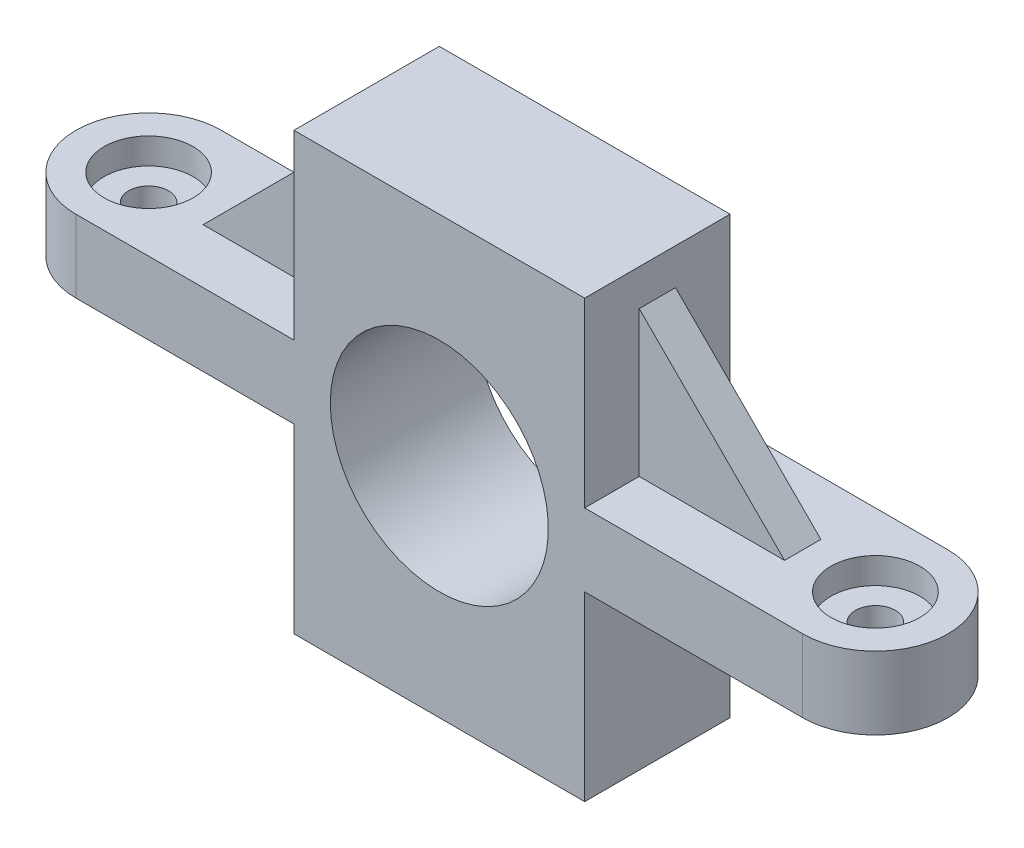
from build123d import *

# Parameters (mm, degrees)
EXTRUDE1_DEPTH                          = 10
FILLET1_RADIUS                          = 10
FILLET1_LENGTH                          = 5
CBORE_FOR_M5_HEX_HEAD_BOLT6_D           = 5.5
CBORE_FOR_M5_HEX_HEAD_BOLT6_CBORE_D     = 12.24
CBORE_FOR_M5_HEX_HEAD_BOLT6_CBORE_DEPTH = 3.58
RIB1_REACH                              = 69.823
SKETCH25_WALL_W                         = 165.93087091
SKETCH25_WALL_H                         = 5


with BuildPart() as part:
    # Sketch1 → Extrude1 (new, symmetric)
    with BuildSketch(Plane.XY):
        with BuildLine():
            Line((-60, 0), (-15, 0))
            ThreePointArc((-15, 0), (-10.606601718, 10.606601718), (0, 15))
            Line((0, 15), (0, 30))
            Line((0, 30), (-20, 30))
            Line((-20, 30), (-20, 5))
            Line((-20, 5), (-60, 5))
            Line((-60, 5), (-60, 0))
        make_face()
    extrude(amount=EXTRUDE1_DEPTH, both=True)

    # Fillet1: full round fillet: the end face becomes a half cylinder, R = half its width
    fillet1_face = Plane((-60, 2.5, 0), x_dir=(0, 1, 0), z_dir=(-1, 0, 0))  # on the end face: x along it, z out of the body
    fillet1_slab = fillet1_face.offset(-FILLET1_RADIUS / 2) * Box(FILLET1_LENGTH, 2 * FILLET1_RADIUS, FILLET1_RADIUS, mode=Mode.PRIVATE)  # the body's end, R deep
    fillet1_round = Plane((-50, 2.5, 0), x_dir=(-1, 0, 0), z_dir=(0, 1, 0)) * Cylinder(FILLET1_RADIUS, FILLET1_LENGTH, mode=Mode.PRIVATE)  # its axis R under the face
    add(fillet1_slab - fillet1_round, mode=Mode.SUBTRACT)

    # Mirror1: part across plane


with BuildPart() as part_1:
    add(part.part)
    add(part.part.mirror(Plane(origin=(0, 30, 10), x_dir=(0, 0, 1), z_dir=(-1, 0, 0))))

    # Mirror2: part across plane


with BuildPart() as part_2:
    add(part_1.part)
    add(part_1.part.mirror(Plane.ZX))

    # CBORE for M5 Hex Head Bolt6 (through all)
    with Locations(Plane(origin=(0, 5, 0), x_dir=(-1, 0, 0), z_dir=(0, 1, 0))):
        with Locations((-50, 0)):
            cbore_for_m5_hex_head_bolt6 = CounterBoreHole(CBORE_FOR_M5_HEX_HEAD_BOLT6_D / 2, CBORE_FOR_M5_HEX_HEAD_BOLT6_CBORE_D / 2, CBORE_FOR_M5_HEX_HEAD_BOLT6_CBORE_DEPTH)

    # Sketch25 wall → Rib1 (add, up to next)
    with BuildSketch(Plane(origin=(30, 15, 0), x_dir=(0.707106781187, -0.707106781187, 0), z_dir=(0.707106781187, 0.707106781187, 0)), mode=Mode.PRIVATE) as rib1_sk1:
        Rectangle(SKETCH25_WALL_W, SKETCH25_WALL_H)
    rib1_tool1 = extrude(rib1_sk1.sketch, amount=-RIB1_REACH, mode=Mode.PRIVATE) - part_2.part
    rib1 = rib1_tool1.solids().sort_by_distance((30, 15, 0))[0]
    add(rib1)

    # Mirror27: CBORE for M5 Hex Head Bolt6, Rib1 across plane
    add(cbore_for_m5_hex_head_bolt6.mirror(Plane(origin=(0, 0, 0), x_dir=(0, 0, 1), z_dir=(1, 0, 0))), mode=Mode.SUBTRACT)
    add(rib1.mirror(Plane(origin=(0, 0, 0), x_dir=(0, 0, 1), z_dir=(1, 0, 0))))


solid = part_2.part
